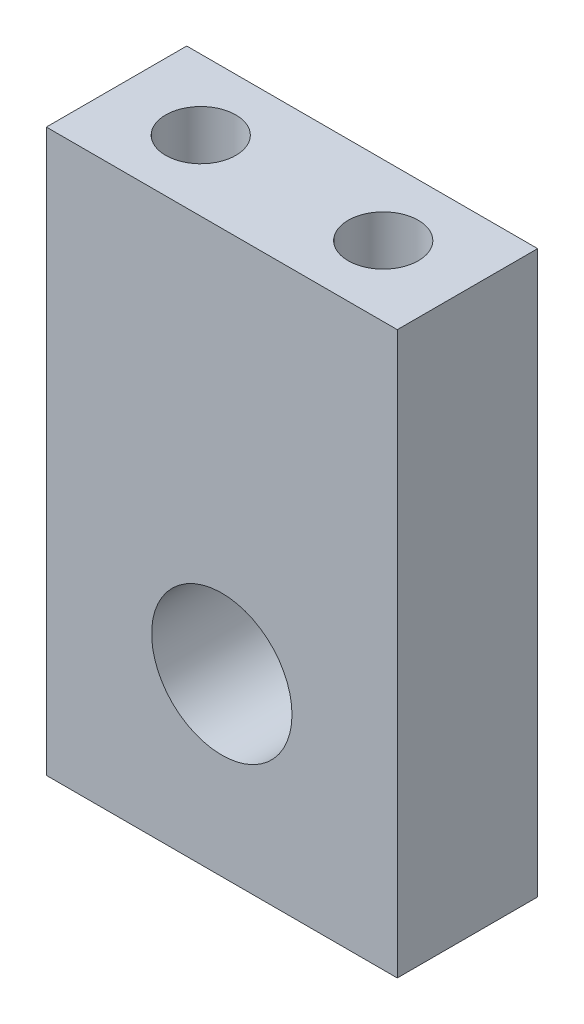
ISO-10303-21;
HEADER;
FILE_DESCRIPTION(('STEP AP214'),'2;1');
FILE_NAME('part.step','',(''),(''),'','','');
FILE_SCHEMA(('AUTOMOTIVE_DESIGN { 1 0 10303 214 1 1 1 1 }'));
ENDSEC;
DATA;
#1=APPLICATION_CONTEXT('core data for automotive mechanical design processes');
#2=APPLICATION_PROTOCOL_DEFINITION('international standard','automotive_design',2000,#1);
#3=PRODUCT_CONTEXT('',#1,'mechanical');
#4=PRODUCT('Part','Part','',(#3));
#5=PRODUCT_RELATED_PRODUCT_CATEGORY('part','',(#4));
#6=PRODUCT_DEFINITION_FORMATION('','',#4);
#7=PRODUCT_DEFINITION_CONTEXT('part definition',#1,'design');
#8=PRODUCT_DEFINITION('design','',#6,#7);
#9=PRODUCT_DEFINITION_SHAPE('','',#8);
#10=(LENGTH_UNIT() NAMED_UNIT(*) SI_UNIT(.MILLI.,.METRE.));
#11=(NAMED_UNIT(*) PLANE_ANGLE_UNIT() SI_UNIT($,.RADIAN.));
#12=(NAMED_UNIT(*) SI_UNIT($,.STERADIAN.) SOLID_ANGLE_UNIT());
#13=UNCERTAINTY_MEASURE_WITH_UNIT(LENGTH_MEASURE(1.E-05),#10,'distance_accuracy_value','');
#14=(GEOMETRIC_REPRESENTATION_CONTEXT(3) GLOBAL_UNCERTAINTY_ASSIGNED_CONTEXT((#13)) GLOBAL_UNIT_ASSIGNED_CONTEXT((#10,
#11,#12)) REPRESENTATION_CONTEXT('',''));
#15=CARTESIAN_POINT('',(0.,0.,0.));
#16=DIRECTION('',(0.,0.,1.));
#17=DIRECTION('',(1.,0.,0.));
#18=AXIS2_PLACEMENT_3D('',#15,#16,#17);
#19=CARTESIAN_POINT('',(-12.5,20.,10.));
#20=DIRECTION('',(1.,0.,0.));
#21=DIRECTION('',(0.,1.,0.));
#22=AXIS2_PLACEMENT_3D('',#19,#20,#21);
#23=PLANE('',#22);
#24=DIRECTION('',(0.,-1.,0.));
#25=VECTOR('',#24,1.);
#26=CARTESIAN_POINT('',(-12.5,20.,0.));
#27=LINE('',#26,#25);
#28=CARTESIAN_POINT('',(-12.5,20.,0.));
#29=VERTEX_POINT('',#28);
#30=CARTESIAN_POINT('',(-12.5,-20.,0.));
#31=VERTEX_POINT('',#30);
#32=EDGE_CURVE('E116',#29,#31,#27,.T.);
#33=ORIENTED_EDGE('',*,*,#32,.T.);
#34=DIRECTION('',(0.,0.,-1.));
#35=VECTOR('',#34,1.);
#36=CARTESIAN_POINT('',(-12.5,-20.,10.));
#37=LINE('',#36,#35);
#38=CARTESIAN_POINT('',(-12.5,-20.,10.));
#39=VERTEX_POINT('',#38);
#40=EDGE_CURVE('E11',#39,#31,#37,.T.);
#41=ORIENTED_EDGE('',*,*,#40,.F.);
#42=DIRECTION('',(0.,-1.,0.));
#43=VECTOR('',#42,1.);
#44=CARTESIAN_POINT('',(-12.5,20.,10.));
#45=LINE('',#44,#43);
#46=CARTESIAN_POINT('',(-12.5,20.,10.));
#47=VERTEX_POINT('',#46);
#48=EDGE_CURVE('E119',#47,#39,#45,.T.);
#49=ORIENTED_EDGE('',*,*,#48,.F.);
#50=DIRECTION('',(0.,0.,-1.));
#51=VECTOR('',#50,1.);
#52=CARTESIAN_POINT('',(-12.5,20.,10.));
#53=LINE('',#52,#51);
#54=EDGE_CURVE('E125',#47,#29,#53,.T.);
#55=ORIENTED_EDGE('',*,*,#54,.T.);
#56=EDGE_LOOP('',(#33,#41,#49,#55));
#57=FACE_BOUND('',#56,.T.);
#58=ADVANCED_FACE('F37',(#57),#23,.F.);
#59=CARTESIAN_POINT('',(12.5,-20.,10.));
#60=DIRECTION('',(0.,1.,0.));
#61=DIRECTION('',(0.,0.,1.));
#62=AXIS2_PLACEMENT_3D('',#59,#60,#61);
#63=PLANE('',#62);
#64=DIRECTION('',(1.,0.,0.));
#65=VECTOR('',#64,1.);
#66=CARTESIAN_POINT('',(12.5,-20.,0.));
#67=LINE('',#66,#65);
#68=CARTESIAN_POINT('',(12.5,-20.,0.));
#69=VERTEX_POINT('',#68);
#70=EDGE_CURVE('E128',#31,#69,#67,.T.);
#71=ORIENTED_EDGE('',*,*,#70,.T.);
#72=DIRECTION('',(0.,0.,-1.));
#73=VECTOR('',#72,1.);
#74=CARTESIAN_POINT('',(12.5,-20.,10.));
#75=LINE('',#74,#73);
#76=CARTESIAN_POINT('',(12.5,-20.,10.));
#77=VERTEX_POINT('',#76);
#78=EDGE_CURVE('E45',#77,#69,#75,.T.);
#79=ORIENTED_EDGE('',*,*,#78,.F.);
#80=DIRECTION('',(1.,0.,0.));
#81=VECTOR('',#80,1.);
#82=CARTESIAN_POINT('',(12.5,-20.,10.));
#83=LINE('',#82,#81);
#84=EDGE_CURVE('E84',#39,#77,#83,.T.);
#85=ORIENTED_EDGE('',*,*,#84,.F.);
#86=ORIENTED_EDGE('',*,*,#40,.T.);
#87=EDGE_LOOP('',(#71,#79,#85,#86));
#88=FACE_BOUND('',#87,.T.);
#89=ADVANCED_FACE('F153',(#88),#63,.F.);
#90=CARTESIAN_POINT('',(12.5,20.,10.));
#91=DIRECTION('',(-1.,0.,0.));
#92=DIRECTION('',(0.,-1.,0.));
#93=AXIS2_PLACEMENT_3D('',#90,#91,#92);
#94=PLANE('',#93);
#95=DIRECTION('',(0.,1.,0.));
#96=VECTOR('',#95,1.);
#97=CARTESIAN_POINT('',(12.5,20.,0.));
#98=LINE('',#97,#96);
#99=CARTESIAN_POINT('',(12.5,20.,0.));
#100=VERTEX_POINT('',#99);
#101=EDGE_CURVE('E71',#69,#100,#98,.T.);
#102=ORIENTED_EDGE('',*,*,#101,.T.);
#103=DIRECTION('',(0.,0.,-1.));
#104=VECTOR('',#103,1.);
#105=CARTESIAN_POINT('',(12.5,20.,10.));
#106=LINE('',#105,#104);
#107=CARTESIAN_POINT('',(12.5,20.,10.));
#108=VERTEX_POINT('',#107);
#109=EDGE_CURVE('E133',#108,#100,#106,.T.);
#110=ORIENTED_EDGE('',*,*,#109,.F.);
#111=DIRECTION('',(0.,1.,0.));
#112=VECTOR('',#111,1.);
#113=CARTESIAN_POINT('',(12.5,20.,10.));
#114=LINE('',#113,#112);
#115=EDGE_CURVE('E122',#77,#108,#114,.T.);
#116=ORIENTED_EDGE('',*,*,#115,.F.);
#117=ORIENTED_EDGE('',*,*,#78,.T.);
#118=EDGE_LOOP('',(#102,#110,#116,#117));
#119=FACE_BOUND('',#118,.T.);
#120=ADVANCED_FACE('F135',(#119),#94,.F.);
#121=CARTESIAN_POINT('',(12.5,20.,10.));
#122=DIRECTION('',(0.,-1.,0.));
#123=DIRECTION('',(0.,0.,-1.));
#124=AXIS2_PLACEMENT_3D('',#121,#122,#123);
#125=PLANE('',#124);
#126=CARTESIAN_POINT('',(-6.5,20.,5.));
#127=DIRECTION('',(0.,1.,0.));
#128=DIRECTION('',(0.,0.,1.));
#129=AXIS2_PLACEMENT_3D('',#126,#127,#128);
#130=CIRCLE('',#129,2.49999999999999);
#131=CARTESIAN_POINT('',(-6.5,20.,7.49999999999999));
#132=VERTEX_POINT('',#131);
#133=EDGE_CURVE('E102',#132,#132,#130,.T.);
#134=ORIENTED_EDGE('',*,*,#133,.F.);
#135=EDGE_LOOP('',(#134));
#136=FACE_BOUND('',#135,.T.);
#137=CARTESIAN_POINT('',(6.5,20.,5.));
#138=DIRECTION('',(0.,1.,0.));
#139=DIRECTION('',(0.,0.,1.));
#140=AXIS2_PLACEMENT_3D('',#137,#138,#139);
#141=CIRCLE('',#140,2.49999999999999);
#142=CARTESIAN_POINT('',(6.5,20.,7.49999999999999));
#143=VERTEX_POINT('',#142);
#144=EDGE_CURVE('E101',#143,#143,#141,.T.);
#145=ORIENTED_EDGE('',*,*,#144,.F.);
#146=EDGE_LOOP('',(#145));
#147=FACE_BOUND('',#146,.T.);
#148=DIRECTION('',(-1.,0.,0.));
#149=VECTOR('',#148,1.);
#150=CARTESIAN_POINT('',(12.5,20.,0.));
#151=LINE('',#150,#149);
#152=EDGE_CURVE('E77',#100,#29,#151,.T.);
#153=ORIENTED_EDGE('',*,*,#152,.T.);
#154=ORIENTED_EDGE('',*,*,#54,.F.);
#155=DIRECTION('',(-1.,0.,0.));
#156=VECTOR('',#155,1.);
#157=CARTESIAN_POINT('',(12.5,20.,10.));
#158=LINE('',#157,#156);
#159=EDGE_CURVE('E53',#108,#47,#158,.T.);
#160=ORIENTED_EDGE('',*,*,#159,.F.);
#161=ORIENTED_EDGE('',*,*,#109,.T.);
#162=EDGE_LOOP('',(#153,#154,#160,#161));
#163=FACE_BOUND('',#162,.T.);
#164=ADVANCED_FACE('F142',(#136,#147,#163),#125,.F.);
#165=CARTESIAN_POINT('',(0.,0.,10.));
#166=DIRECTION('',(0.,0.,-1.));
#167=DIRECTION('',(-1.,0.,0.));
#168=AXIS2_PLACEMENT_3D('',#165,#166,#167);
#169=PLANE('',#168);
#170=CARTESIAN_POINT('',(0.,-7.5,10.));
#171=DIRECTION('',(0.,0.,1.));
#172=DIRECTION('',(1.,0.,0.));
#173=AXIS2_PLACEMENT_3D('',#170,#171,#172);
#174=CIRCLE('',#173,5.);
#175=CARTESIAN_POINT('',(5.,-7.5,10.));
#176=VERTEX_POINT('',#175);
#177=EDGE_CURVE('E112',#176,#176,#174,.T.);
#178=ORIENTED_EDGE('',*,*,#177,.F.);
#179=EDGE_LOOP('',(#178));
#180=FACE_BOUND('',#179,.T.);
#181=ORIENTED_EDGE('',*,*,#48,.T.);
#182=ORIENTED_EDGE('',*,*,#84,.T.);
#183=ORIENTED_EDGE('',*,*,#115,.T.);
#184=ORIENTED_EDGE('',*,*,#159,.T.);
#185=EDGE_LOOP('',(#181,#182,#183,#184));
#186=FACE_BOUND('',#185,.T.);
#187=ADVANCED_FACE('F144',(#180,#186),#169,.F.);
#188=CARTESIAN_POINT('',(0.,0.,0.));
#189=DIRECTION('',(0.,0.,-1.));
#190=DIRECTION('',(-1.,0.,0.));
#191=AXIS2_PLACEMENT_3D('',#188,#189,#190);
#192=PLANE('',#191);
#193=CARTESIAN_POINT('',(0.,-7.5,0.));
#194=DIRECTION('',(0.,0.,1.));
#195=DIRECTION('',(1.,0.,0.));
#196=AXIS2_PLACEMENT_3D('',#193,#194,#195);
#197=CIRCLE('',#196,5.);
#198=CARTESIAN_POINT('',(5.,-7.5,0.));
#199=VERTEX_POINT('',#198);
#200=EDGE_CURVE('E113',#199,#199,#197,.T.);
#201=ORIENTED_EDGE('',*,*,#200,.T.);
#202=EDGE_LOOP('',(#201));
#203=FACE_BOUND('',#202,.T.);
#204=ORIENTED_EDGE('',*,*,#32,.F.);
#205=ORIENTED_EDGE('',*,*,#152,.F.);
#206=ORIENTED_EDGE('',*,*,#101,.F.);
#207=ORIENTED_EDGE('',*,*,#70,.F.);
#208=EDGE_LOOP('',(#204,#205,#206,#207));
#209=FACE_BOUND('',#208,.T.);
#210=ADVANCED_FACE('F138',(#203,#209),#192,.T.);
#211=CARTESIAN_POINT('',(0.,-7.5,0.));
#212=DIRECTION('',(0.,0.,1.));
#213=DIRECTION('',(1.,0.,0.));
#214=AXIS2_PLACEMENT_3D('',#211,#212,#213);
#215=CYLINDRICAL_SURFACE('',#214,5.);
#216=ORIENTED_EDGE('',*,*,#200,.F.);
#217=EDGE_LOOP('',(#216));
#218=FACE_BOUND('',#217,.T.);
#219=ORIENTED_EDGE('',*,*,#177,.T.);
#220=EDGE_LOOP('',(#219));
#221=FACE_BOUND('',#220,.T.);
#222=ADVANCED_FACE('F184',(#218,#221),#215,.F.);
#223=CARTESIAN_POINT('',(6.5,3.,5.));
#224=DIRECTION('',(0.,1.,0.));
#225=DIRECTION('',(0.,0.,1.));
#226=AXIS2_PLACEMENT_3D('',#223,#224,#225);
#227=CONICAL_SURFACE('',#226,2.5,1.02974425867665);
#228=CARTESIAN_POINT('',(6.49999999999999,1.4978484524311,5.));
#229=VERTEX_POINT('',#228);
#230=VERTEX_LOOP('',#229);
#231=FACE_BOUND('',#230,.T.);
#232=CARTESIAN_POINT('',(6.5,3.,5.));
#233=DIRECTION('',(0.,1.,0.));
#234=DIRECTION('',(0.,0.,1.));
#235=AXIS2_PLACEMENT_3D('',#232,#233,#234);
#236=CIRCLE('',#235,2.5);
#237=CARTESIAN_POINT('',(6.5,3.,7.5));
#238=VERTEX_POINT('',#237);
#239=EDGE_CURVE('E105',#238,#238,#236,.T.);
#240=ORIENTED_EDGE('',*,*,#239,.T.);
#241=EDGE_LOOP('',(#240));
#242=FACE_BOUND('',#241,.T.);
#243=ADVANCED_FACE('F192',(#231,#242),#227,.F.);
#244=CARTESIAN_POINT('',(6.5,20.,5.));
#245=DIRECTION('',(0.,1.,0.));
#246=DIRECTION('',(0.,0.,1.));
#247=AXIS2_PLACEMENT_3D('',#244,#245,#246);
#248=CYLINDRICAL_SURFACE('',#247,2.49999999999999);
#249=ORIENTED_EDGE('',*,*,#239,.F.);
#250=EDGE_LOOP('',(#249));
#251=FACE_BOUND('',#250,.T.);
#252=ORIENTED_EDGE('',*,*,#144,.T.);
#253=EDGE_LOOP('',(#252));
#254=FACE_BOUND('',#253,.T.);
#255=ADVANCED_FACE('F95',(#251,#254),#248,.F.);
#256=CARTESIAN_POINT('',(-6.5,3.,5.));
#257=DIRECTION('',(0.,1.,0.));
#258=DIRECTION('',(0.,0.,1.));
#259=AXIS2_PLACEMENT_3D('',#256,#257,#258);
#260=CONICAL_SURFACE('',#259,2.5,1.02974425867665);
#261=CARTESIAN_POINT('',(-6.50000000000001,1.4978484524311,5.));
#262=VERTEX_POINT('',#261);
#263=VERTEX_LOOP('',#262);
#264=FACE_BOUND('',#263,.T.);
#265=CARTESIAN_POINT('',(-6.5,3.,5.));
#266=DIRECTION('',(0.,1.,0.));
#267=DIRECTION('',(0.,0.,1.));
#268=AXIS2_PLACEMENT_3D('',#265,#266,#267);
#269=CIRCLE('',#268,2.5);
#270=CARTESIAN_POINT('',(-6.5,3.,7.5));
#271=VERTEX_POINT('',#270);
#272=EDGE_CURVE('E99',#271,#271,#269,.T.);
#273=ORIENTED_EDGE('',*,*,#272,.T.);
#274=EDGE_LOOP('',(#273));
#275=FACE_BOUND('',#274,.T.);
#276=ADVANCED_FACE('F91',(#264,#275),#260,.F.);
#277=CARTESIAN_POINT('',(-6.5,20.,5.));
#278=DIRECTION('',(0.,1.,0.));
#279=DIRECTION('',(0.,0.,1.));
#280=AXIS2_PLACEMENT_3D('',#277,#278,#279);
#281=CYLINDRICAL_SURFACE('',#280,2.49999999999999);
#282=ORIENTED_EDGE('',*,*,#272,.F.);
#283=EDGE_LOOP('',(#282));
#284=FACE_BOUND('',#283,.T.);
#285=ORIENTED_EDGE('',*,*,#133,.T.);
#286=EDGE_LOOP('',(#285));
#287=FACE_BOUND('',#286,.T.);
#288=ADVANCED_FACE('F94',(#284,#287),#281,.F.);
#289=CLOSED_SHELL('',(#58,#89,#120,#164,#187,#210,#222,#243,#255,#276,#288));
#290=MANIFOLD_SOLID_BREP('B2',#289);
#291=ADVANCED_BREP_SHAPE_REPRESENTATION('',(#18,#290),#14);
#292=SHAPE_DEFINITION_REPRESENTATION(#9,#291);
ENDSEC;
END-ISO-10303-21;
